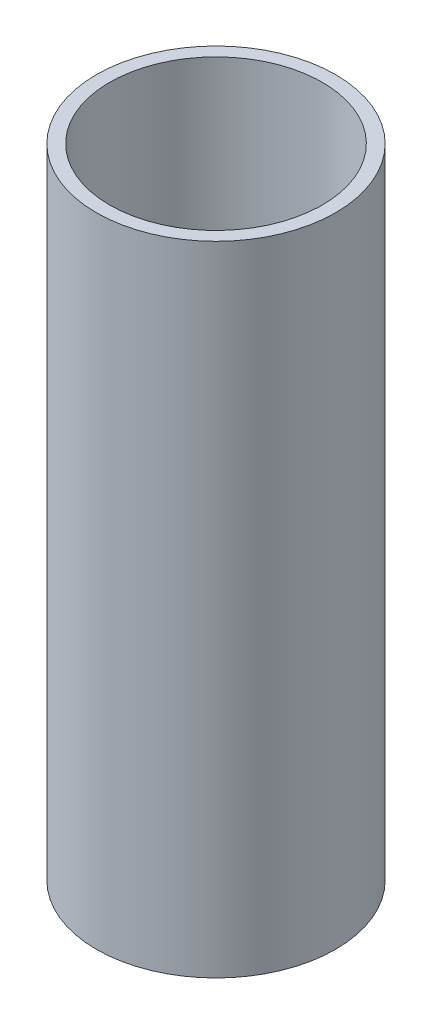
from build123d import *

# Parameters (mm, degrees)
SKETCH1_R               = 90
FULL_CASING_DEPTH       = 480
SKETCH2_R               = 80
ELECTRONICS_SPACE_DEPTH = 235
BLADDER_START           = -235
SKETCH3_R               = 80
BLADDER_SPACE_DEPTH     = 235


with BuildPart() as part:
    # Sketch1 → Full Casing (new body)
    with BuildSketch(Plane(origin=(0, 0, 0), x_dir=(1, 0, 0), z_dir=(0, 1, 0))):
        with Locations(Location((0, 0, 0), (0, 0, 270))):
            Circle(SKETCH1_R)
    extrude(amount=FULL_CASING_DEPTH)

    # Sketch2 → Electronics Space (cut)
    with BuildSketch(Plane.XZ):
        with Locations(Location((0, 0, 0), (0, 0, 270))):
            Circle(SKETCH2_R)
    extrude(amount=-ELECTRONICS_SPACE_DEPTH, mode=Mode.SUBTRACT)

    # Sketch3 → Bladder Space (cut)
    with BuildSketch(Plane(origin=(0, 480, 0), x_dir=(1, 0, 0), z_dir=(0, 1, 0)).offset(BLADDER_START)):
        with Locations(Location((0, 0, 0), (0, 0, 90))):
            Circle(SKETCH3_R)
    extrude(amount=BLADDER_SPACE_DEPTH, mode=Mode.SUBTRACT)


solid = part.part
